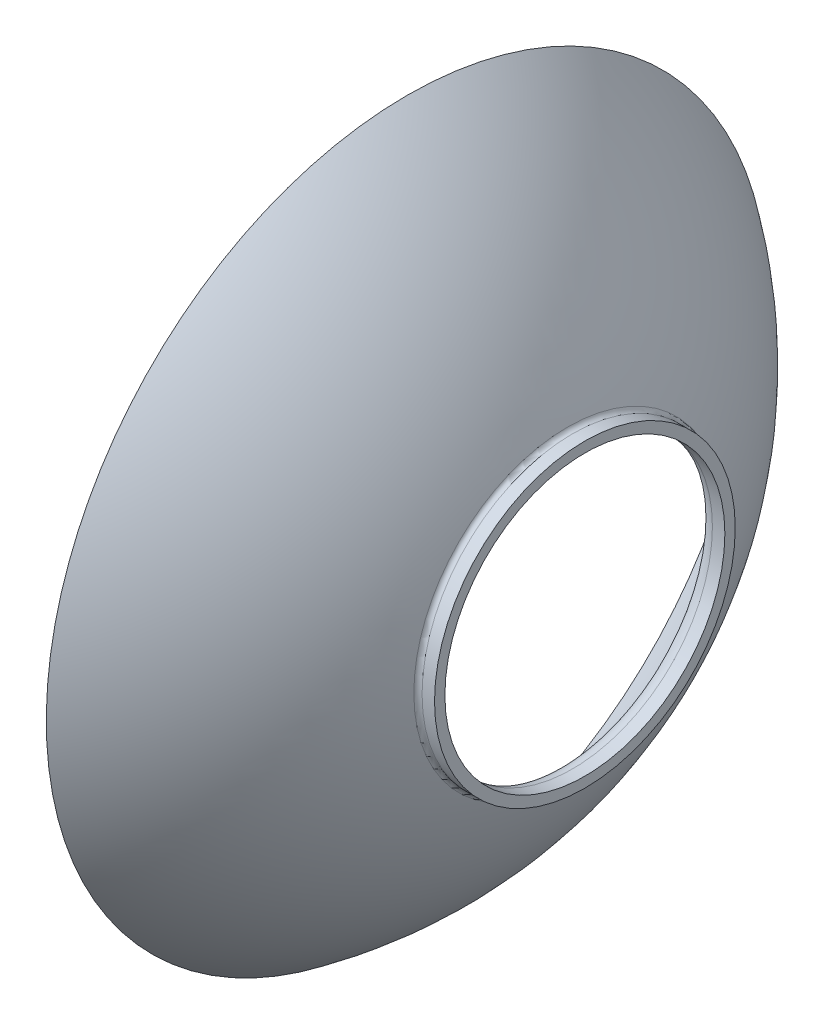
from build123d import *


with BuildPart() as part:
    # Esquisse1 → R_vol.-Mince1 (revolve)
    with BuildSketch(Plane.XY, mode=Mode.PRIVATE) as r_vol_mince1_sk:
        with BuildLine():
            ThreePointArc((23.803422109, 33.994809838), (32.832186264, 25.383016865), (38.893108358, 14.476744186))
            ThreePointArc((38.893108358, 14.476744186), (39.442987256, 13.768155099), (40.298883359, 13.5))
            Line((40.298883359, 13.5), (41.5, 13.5))
            Line((41.5, 13.5), (41.5, 14.5))
            Line((41.5, 14.5), (40.298883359, 14.5))
            ThreePointArc((40.298883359, 14.5), (40.013584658, 14.589385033), (39.830291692, 14.825581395))
            ThreePointArc((39.830291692, 14.825581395), (33.623323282, 25.994655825), (24.376998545, 34.813961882))
            Line((24.376998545, 34.813961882), (23.803422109, 33.994809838))
        make_face()
    revolve(r_vol_mince1_sk.sketch.rotate(Axis((0, 0, 0), (1, 0, 0)), 90), axis=Axis((0, 0, 0), (1, 0, 0)))


solid = part.part
